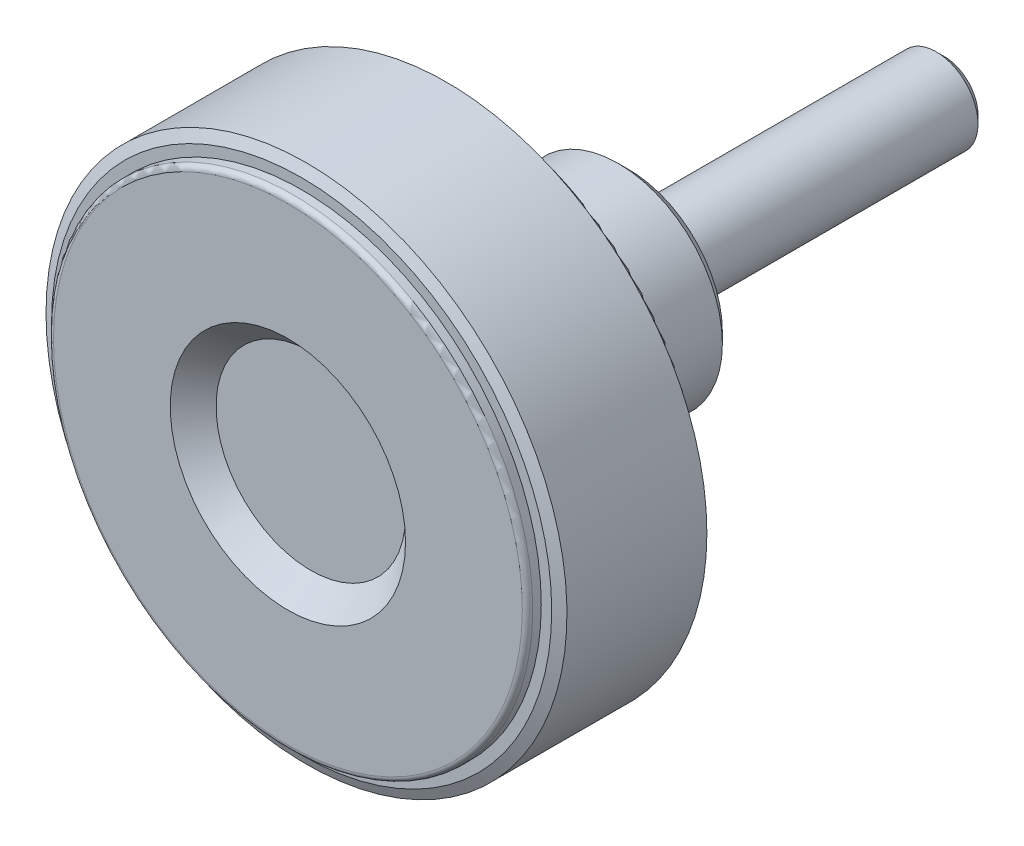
ISO-10303-21;
HEADER;
FILE_DESCRIPTION(('STEP AP214'),'2;1');
FILE_NAME('part.step','',(''),(''),'','','');
FILE_SCHEMA(('AUTOMOTIVE_DESIGN { 1 0 10303 214 1 1 1 1 }'));
ENDSEC;
DATA;
#1=APPLICATION_CONTEXT('core data for automotive mechanical design processes');
#2=APPLICATION_PROTOCOL_DEFINITION('international standard','automotive_design',2000,#1);
#3=PRODUCT_CONTEXT('',#1,'mechanical');
#4=PRODUCT('Part','Part','',(#3));
#5=PRODUCT_RELATED_PRODUCT_CATEGORY('part','',(#4));
#6=PRODUCT_DEFINITION_FORMATION('','',#4);
#7=PRODUCT_DEFINITION_CONTEXT('part definition',#1,'design');
#8=PRODUCT_DEFINITION('design','',#6,#7);
#9=PRODUCT_DEFINITION_SHAPE('','',#8);
#10=(LENGTH_UNIT() NAMED_UNIT(*) SI_UNIT(.MILLI.,.METRE.));
#11=(NAMED_UNIT(*) PLANE_ANGLE_UNIT() SI_UNIT($,.RADIAN.));
#12=(NAMED_UNIT(*) SI_UNIT($,.STERADIAN.) SOLID_ANGLE_UNIT());
#13=UNCERTAINTY_MEASURE_WITH_UNIT(LENGTH_MEASURE(1.E-05),#10,'distance_accuracy_value','');
#14=(GEOMETRIC_REPRESENTATION_CONTEXT(3) GLOBAL_UNCERTAINTY_ASSIGNED_CONTEXT((#13)) GLOBAL_UNIT_ASSIGNED_CONTEXT((#10,
#11,#12)) REPRESENTATION_CONTEXT('',''));
#15=CARTESIAN_POINT('',(0.,0.,0.));
#16=DIRECTION('',(0.,0.,1.));
#17=DIRECTION('',(1.,0.,0.));
#18=AXIS2_PLACEMENT_3D('',#15,#16,#17);
#19=CARTESIAN_POINT('',(0.,1.6165,-30.));
#20=DIRECTION('',(0.,0.,-1.));
#21=DIRECTION('',(-1.,0.,0.));
#22=AXIS2_PLACEMENT_3D('',#19,#20,#21);
#23=PLANE('',#22);
#24=CARTESIAN_POINT('',(0.,0.,-30.0000000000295));
#25=DIRECTION('',(0.,0.,1.));
#26=DIRECTION('',(1.,0.,0.));
#27=AXIS2_PLACEMENT_3D('',#24,#25,#26);
#28=CIRCLE('',#27,3.23299999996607);
#29=CARTESIAN_POINT('',(3.23299999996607,0.,-30.0000000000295));
#30=VERTEX_POINT('',#29);
#31=EDGE_CURVE('E179',#30,#30,#28,.T.);
#32=ORIENTED_EDGE('',*,*,#31,.F.);
#33=EDGE_LOOP('',(#32));
#34=FACE_BOUND('',#33,.T.);
#35=ADVANCED_FACE('F14',(#34),#23,.T.);
#36=CARTESIAN_POINT('',(0.,0.,-29.2329999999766));
#37=DIRECTION('',(0.,0.,1.));
#38=DIRECTION('',(1.,0.,0.));
#39=AXIS2_PLACEMENT_3D('',#36,#37,#38);
#40=CONICAL_SURFACE('',#39,3.99999999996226,0.785398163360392);
#41=ORIENTED_EDGE('',*,*,#31,.T.);
#42=EDGE_LOOP('',(#41));
#43=FACE_BOUND('',#42,.T.);
#44=CARTESIAN_POINT('',(0.,0.,-29.233));
#45=DIRECTION('',(0.,0.,1.));
#46=DIRECTION('',(1.,0.,0.));
#47=AXIS2_PLACEMENT_3D('',#44,#45,#46);
#48=CIRCLE('',#47,4.);
#49=CARTESIAN_POINT('',(4.,0.,-29.233));
#50=VERTEX_POINT('',#49);
#51=EDGE_CURVE('E176',#50,#50,#48,.T.);
#52=ORIENTED_EDGE('',*,*,#51,.F.);
#53=EDGE_LOOP('',(#52));
#54=FACE_BOUND('',#53,.T.);
#55=ADVANCED_FACE('F510',(#43,#54),#40,.T.);
#56=CARTESIAN_POINT('',(0.,0.,-14.1165));
#57=DIRECTION('',(0.,0.,1.));
#58=DIRECTION('',(1.,0.,0.));
#59=AXIS2_PLACEMENT_3D('',#56,#57,#58);
#60=CYLINDRICAL_SURFACE('',#59,4.);
#61=ORIENTED_EDGE('',*,*,#51,.T.);
#62=EDGE_LOOP('',(#61));
#63=FACE_BOUND('',#62,.T.);
#64=CARTESIAN_POINT('',(0.,0.,0.));
#65=DIRECTION('',(0.,0.,1.));
#66=DIRECTION('',(1.,0.,0.));
#67=AXIS2_PLACEMENT_3D('',#64,#65,#66);
#68=CIRCLE('',#67,4.);
#69=CARTESIAN_POINT('',(4.,0.,0.));
#70=VERTEX_POINT('',#69);
#71=EDGE_CURVE('E178',#70,#70,#68,.T.);
#72=ORIENTED_EDGE('',*,*,#71,.F.);
#73=EDGE_LOOP('',(#72));
#74=FACE_BOUND('',#73,.T.);
#75=ADVANCED_FACE('F501',(#63,#74),#60,.T.);
#76=CARTESIAN_POINT('',(0.,2.66666666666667,0.));
#77=DIRECTION('',(0.,0.,-1.));
#78=DIRECTION('',(-1.,0.,0.));
#79=AXIS2_PLACEMENT_3D('',#76,#77,#78);
#80=PLANE('',#79);
#81=CARTESIAN_POINT('',(0.,0.,0.));
#82=DIRECTION('',(0.,0.,1.));
#83=DIRECTION('',(1.,0.,0.));
#84=AXIS2_PLACEMENT_3D('',#81,#82,#83);
#85=CIRCLE('',#84,5.33333333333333);
#86=CARTESIAN_POINT('',(5.33333333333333,0.,0.));
#87=VERTEX_POINT('',#86);
#88=EDGE_CURVE('E211',#87,#87,#85,.T.);
#89=ORIENTED_EDGE('',*,*,#88,.F.);
#90=EDGE_LOOP('',(#89));
#91=FACE_BOUND('',#90,.T.);
#92=ORIENTED_EDGE('',*,*,#71,.T.);
#93=EDGE_LOOP('',(#92));
#94=FACE_BOUND('',#93,.T.);
#95=ADVANCED_FACE('F492',(#91,#94),#80,.T.);
#96=CARTESIAN_POINT('',(0.,0.,0.15));
#97=DIRECTION('',(0.,0.,1.));
#98=DIRECTION('',(1.,0.,0.));
#99=AXIS2_PLACEMENT_3D('',#96,#97,#98);
#100=CYLINDRICAL_SURFACE('',#99,5.33333333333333);
#101=ORIENTED_EDGE('',*,*,#88,.T.);
#102=EDGE_LOOP('',(#101));
#103=FACE_BOUND('',#102,.T.);
#104=CARTESIAN_POINT('',(0.,0.,0.3));
#105=DIRECTION('',(0.,0.,1.));
#106=DIRECTION('',(1.,0.,0.));
#107=AXIS2_PLACEMENT_3D('',#104,#105,#106);
#108=CIRCLE('',#107,5.33333333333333);
#109=CARTESIAN_POINT('',(5.33333333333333,0.,0.3));
#110=VERTEX_POINT('',#109);
#111=EDGE_CURVE('E208',#110,#110,#108,.T.);
#112=ORIENTED_EDGE('',*,*,#111,.F.);
#113=EDGE_LOOP('',(#112));
#114=FACE_BOUND('',#113,.T.);
#115=ADVANCED_FACE('F483',(#103,#114),#100,.T.);
#116=CARTESIAN_POINT('',(0.,7.16666666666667,0.3));
#117=DIRECTION('',(0.,0.,-1.));
#118=DIRECTION('',(-1.,0.,0.));
#119=AXIS2_PLACEMENT_3D('',#116,#117,#118);
#120=PLANE('',#119);
#121=CARTESIAN_POINT('',(0.,0.,0.3));
#122=DIRECTION('',(0.,0.,1.));
#123=DIRECTION('',(1.,0.,0.));
#124=AXIS2_PLACEMENT_3D('',#121,#122,#123);
#125=CIRCLE('',#124,9.);
#126=CARTESIAN_POINT('',(9.,0.,0.3));
#127=VERTEX_POINT('',#126);
#128=EDGE_CURVE('E175',#127,#127,#125,.T.);
#129=ORIENTED_EDGE('',*,*,#128,.F.);
#130=EDGE_LOOP('',(#129));
#131=FACE_BOUND('',#130,.T.);
#132=ORIENTED_EDGE('',*,*,#111,.T.);
#133=EDGE_LOOP('',(#132));
#134=FACE_BOUND('',#133,.T.);
#135=ADVANCED_FACE('F474',(#131,#134),#120,.T.);
#136=CARTESIAN_POINT('',(0.,0.,1.3));
#137=DIRECTION('',(0.,0.,1.));
#138=DIRECTION('',(1.,0.,0.));
#139=AXIS2_PLACEMENT_3D('',#136,#137,#138);
#140=CONICAL_SURFACE('',#139,10.,0.785398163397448);
#141=ORIENTED_EDGE('',*,*,#128,.T.);
#142=EDGE_LOOP('',(#141));
#143=FACE_BOUND('',#142,.T.);
#144=CARTESIAN_POINT('',(0.,0.,1.3));
#145=DIRECTION('',(0.,0.,1.));
#146=DIRECTION('',(1.,0.,0.));
#147=AXIS2_PLACEMENT_3D('',#144,#145,#146);
#148=CIRCLE('',#147,10.);
#149=CARTESIAN_POINT('',(10.,0.,1.3));
#150=VERTEX_POINT('',#149);
#151=EDGE_CURVE('E172',#150,#150,#148,.T.);
#152=ORIENTED_EDGE('',*,*,#151,.F.);
#153=EDGE_LOOP('',(#152));
#154=FACE_BOUND('',#153,.T.);
#155=ADVANCED_FACE('F466',(#143,#154),#140,.T.);
#156=CARTESIAN_POINT('',(0.,0.,13.9));
#157=DIRECTION('',(0.,0.,1.));
#158=DIRECTION('',(1.,0.,0.));
#159=AXIS2_PLACEMENT_3D('',#156,#157,#158);
#160=CYLINDRICAL_SURFACE('',#159,10.);
#161=ORIENTED_EDGE('',*,*,#151,.T.);
#162=EDGE_LOOP('',(#161));
#163=FACE_BOUND('',#162,.T.);
#164=CARTESIAN_POINT('',(0.,0.,26.5));
#165=DIRECTION('',(0.,0.,-1.));
#166=DIRECTION('',(-1.,0.,0.));
#167=AXIS2_PLACEMENT_3D('',#164,#165,#166);
#168=CIRCLE('',#167,10.);
#169=CARTESIAN_POINT('',(-10.,0.,26.5));
#170=VERTEX_POINT('',#169);
#171=EDGE_CURVE('E75',#170,#170,#168,.T.);
#172=ORIENTED_EDGE('',*,*,#171,.T.);
#173=EDGE_LOOP('',(#172));
#174=FACE_BOUND('',#173,.T.);
#175=ADVANCED_FACE('F459',(#163,#174),#160,.T.);
#176=CARTESIAN_POINT('',(0.,0.,26.5));
#177=DIRECTION('',(0.,0.,-1.));
#178=DIRECTION('',(-1.,0.,0.));
#179=AXIS2_PLACEMENT_3D('',#176,#177,#178);
#180=TOROIDAL_SURFACE('',#179,11.,1.);
#181=CARTESIAN_POINT('',(0.,0.,27.5));
#182=DIRECTION('',(0.,0.,-1.));
#183=DIRECTION('',(1.,0.,0.));
#184=AXIS2_PLACEMENT_3D('',#181,#182,#183);
#185=CIRCLE('',#184,11.);
#186=CARTESIAN_POINT('',(-11.,0.,27.5));
#187=VERTEX_POINT('',#186);
#188=CARTESIAN_POINT('',(11.,0.,27.5));
#189=VERTEX_POINT('',#188);
#190=EDGE_CURVE('E68',#187,#189,#185,.F.);
#191=ORIENTED_EDGE('',*,*,#190,.F.);
#192=CARTESIAN_POINT('',(0.,0.,27.5));
#193=DIRECTION('',(0.,0.,-1.));
#194=DIRECTION('',(-1.,0.,0.));
#195=AXIS2_PLACEMENT_3D('',#192,#193,#194);
#196=CIRCLE('',#195,11.);
#197=CARTESIAN_POINT('',(0.,11.,27.5));
#198=VERTEX_POINT('',#197);
#199=EDGE_CURVE('E71',#198,#187,#196,.F.);
#200=ORIENTED_EDGE('',*,*,#199,.F.);
#201=CARTESIAN_POINT('',(0.,0.,27.5));
#202=DIRECTION('',(0.,0.,-1.));
#203=DIRECTION('',(0.,1.,0.));
#204=AXIS2_PLACEMENT_3D('',#201,#202,#203);
#205=CIRCLE('',#204,11.);
#206=EDGE_CURVE('E63',#189,#198,#205,.F.);
#207=ORIENTED_EDGE('',*,*,#206,.F.);
#208=EDGE_LOOP('',(#191,#200,#207));
#209=FACE_BOUND('',#208,.T.);
#210=ORIENTED_EDGE('',*,*,#171,.F.);
#211=EDGE_LOOP('',(#210));
#212=FACE_BOUND('',#211,.T.);
#213=ADVANCED_FACE('F66',(#209,#212),#180,.F.);
#214=CARTESIAN_POINT('',(0.,14.6153846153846,27.5));
#215=DIRECTION('',(0.,0.,-1.));
#216=DIRECTION('',(-1.,0.,0.));
#217=AXIS2_PLACEMENT_3D('',#214,#215,#216);
#218=PLANE('',#217);
#219=CARTESIAN_POINT('',(0.,0.,27.5));
#220=DIRECTION('',(0.,0.,1.));
#221=DIRECTION('',(-1.,0.,0.));
#222=AXIS2_PLACEMENT_3D('',#219,#220,#221);
#223=CIRCLE('',#222,18.2307692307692);
#224=CARTESIAN_POINT('',(18.2307692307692,0.,27.5));
#225=VERTEX_POINT('',#224);
#226=CARTESIAN_POINT('',(-18.2307692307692,0.,27.5));
#227=VERTEX_POINT('',#226);
#228=EDGE_CURVE('E81',#225,#227,#223,.F.);
#229=ORIENTED_EDGE('',*,*,#228,.T.);
#230=CARTESIAN_POINT('',(0.,0.,27.5));
#231=DIRECTION('',(0.,0.,1.));
#232=DIRECTION('',(0.,1.,0.));
#233=AXIS2_PLACEMENT_3D('',#230,#231,#232);
#234=CIRCLE('',#233,18.2307692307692);
#235=CARTESIAN_POINT('',(0.,18.2307692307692,27.5));
#236=VERTEX_POINT('',#235);
#237=EDGE_CURVE('E130',#227,#236,#234,.F.);
#238=ORIENTED_EDGE('',*,*,#237,.T.);
#239=CARTESIAN_POINT('',(0.,0.,27.5));
#240=DIRECTION('',(0.,0.,1.));
#241=DIRECTION('',(1.,0.,0.));
#242=AXIS2_PLACEMENT_3D('',#239,#240,#241);
#243=CIRCLE('',#242,18.2307692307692);
#244=EDGE_CURVE('E143',#236,#225,#243,.F.);
#245=ORIENTED_EDGE('',*,*,#244,.T.);
#246=EDGE_LOOP('',(#229,#238,#245));
#247=FACE_BOUND('',#246,.T.);
#248=ORIENTED_EDGE('',*,*,#199,.T.);
#249=ORIENTED_EDGE('',*,*,#190,.T.);
#250=ORIENTED_EDGE('',*,*,#206,.T.);
#251=EDGE_LOOP('',(#248,#249,#250));
#252=FACE_BOUND('',#251,.T.);
#253=ADVANCED_FACE('F79',(#247,#252),#218,.T.);
#254=CARTESIAN_POINT('',(0.,0.,26.5));
#255=DIRECTION('',(0.,0.,-1.));
#256=DIRECTION('',(-1.,0.,0.));
#257=AXIS2_PLACEMENT_3D('',#254,#255,#256);
#258=TOROIDAL_SURFACE('',#257,18.2307692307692,1.);
#259=ORIENTED_EDGE('',*,*,#237,.F.);
#260=ORIENTED_EDGE('',*,*,#228,.F.);
#261=ORIENTED_EDGE('',*,*,#244,.F.);
#262=EDGE_LOOP('',(#259,#260,#261));
#263=FACE_BOUND('',#262,.T.);
#264=CARTESIAN_POINT('',(0.,0.,26.5));
#265=DIRECTION('',(0.,0.,1.));
#266=DIRECTION('',(1.,0.,0.));
#267=AXIS2_PLACEMENT_3D('',#264,#265,#266);
#268=CIRCLE('',#267,19.2307692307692);
#269=CARTESIAN_POINT('',(19.2307692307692,0.,26.5));
#270=VERTEX_POINT('',#269);
#271=EDGE_CURVE('E205',#270,#270,#268,.F.);
#272=ORIENTED_EDGE('',*,*,#271,.T.);
#273=EDGE_LOOP('',(#272));
#274=FACE_BOUND('',#273,.T.);
#275=ADVANCED_FACE('F100',(#263,#274),#258,.F.);
#276=CARTESIAN_POINT('',(0.,0.,21.25));
#277=DIRECTION('',(0.,0.,1.));
#278=DIRECTION('',(1.,0.,0.));
#279=AXIS2_PLACEMENT_3D('',#276,#277,#278);
#280=CYLINDRICAL_SURFACE('',#279,19.2307692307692);
#281=ORIENTED_EDGE('',*,*,#271,.F.);
#282=EDGE_LOOP('',(#281));
#283=FACE_BOUND('',#282,.T.);
#284=CARTESIAN_POINT('',(0.,0.,16.));
#285=DIRECTION('',(0.,0.,1.));
#286=DIRECTION('',(1.,0.,0.));
#287=AXIS2_PLACEMENT_3D('',#284,#285,#286);
#288=CIRCLE('',#287,19.2307692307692);
#289=CARTESIAN_POINT('',(19.2307692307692,0.,16.));
#290=VERTEX_POINT('',#289);
#291=EDGE_CURVE('E201',#290,#290,#288,.T.);
#292=ORIENTED_EDGE('',*,*,#291,.F.);
#293=EDGE_LOOP('',(#292));
#294=FACE_BOUND('',#293,.T.);
#295=ADVANCED_FACE('F329',(#283,#294),#280,.F.);
#296=CARTESIAN_POINT('',(0.,20.8653846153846,16.));
#297=DIRECTION('',(0.,0.,-1.));
#298=DIRECTION('',(-1.,0.,0.));
#299=AXIS2_PLACEMENT_3D('',#296,#297,#298);
#300=PLANE('',#299);
#301=CARTESIAN_POINT('',(0.,0.,16.));
#302=DIRECTION('',(0.,0.,1.));
#303=DIRECTION('',(-1.,0.,0.));
#304=AXIS2_PLACEMENT_3D('',#301,#302,#303);
#305=CIRCLE('',#304,22.5);
#306=CARTESIAN_POINT('',(-22.5,0.,16.));
#307=VERTEX_POINT('',#306);
#308=CARTESIAN_POINT('',(22.5,0.,16.));
#309=VERTEX_POINT('',#308);
#310=EDGE_CURVE('E264',#307,#309,#305,.T.);
#311=ORIENTED_EDGE('',*,*,#310,.F.);
#312=CARTESIAN_POINT('',(0.,0.,16.));
#313=DIRECTION('',(0.,0.,1.));
#314=DIRECTION('',(0.,1.,0.));
#315=AXIS2_PLACEMENT_3D('',#312,#313,#314);
#316=CIRCLE('',#315,22.5);
#317=CARTESIAN_POINT('',(0.,22.5,16.));
#318=VERTEX_POINT('',#317);
#319=EDGE_CURVE('E299',#318,#307,#316,.T.);
#320=ORIENTED_EDGE('',*,*,#319,.F.);
#321=CARTESIAN_POINT('',(0.,0.,16.));
#322=DIRECTION('',(0.,0.,1.));
#323=DIRECTION('',(1.,0.,0.));
#324=AXIS2_PLACEMENT_3D('',#321,#322,#323);
#325=CIRCLE('',#324,22.5);
#326=EDGE_CURVE('E204',#309,#318,#325,.T.);
#327=ORIENTED_EDGE('',*,*,#326,.F.);
#328=EDGE_LOOP('',(#311,#320,#327));
#329=FACE_BOUND('',#328,.T.);
#330=ORIENTED_EDGE('',*,*,#291,.T.);
#331=EDGE_LOOP('',(#330));
#332=FACE_BOUND('',#331,.T.);
#333=ADVANCED_FACE('F275',(#329,#332),#300,.T.);
#334=CARTESIAN_POINT('',(0.,0.,16.5));
#335=DIRECTION('',(0.,0.,-1.));
#336=DIRECTION('',(-1.,0.,0.));
#337=AXIS2_PLACEMENT_3D('',#334,#335,#336);
#338=TOROIDAL_SURFACE('',#337,22.5,0.5);
#339=ORIENTED_EDGE('',*,*,#319,.T.);
#340=ORIENTED_EDGE('',*,*,#310,.T.);
#341=ORIENTED_EDGE('',*,*,#326,.T.);
#342=EDGE_LOOP('',(#339,#340,#341));
#343=FACE_BOUND('',#342,.T.);
#344=CARTESIAN_POINT('',(0.,0.,16.5));
#345=DIRECTION('',(0.,0.,1.));
#346=DIRECTION('',(1.,0.,0.));
#347=AXIS2_PLACEMENT_3D('',#344,#345,#346);
#348=CIRCLE('',#347,23.);
#349=CARTESIAN_POINT('',(23.,0.,16.5));
#350=VERTEX_POINT('',#349);
#351=EDGE_CURVE('E200',#350,#350,#348,.T.);
#352=ORIENTED_EDGE('',*,*,#351,.F.);
#353=EDGE_LOOP('',(#352));
#354=FACE_BOUND('',#353,.T.);
#355=ADVANCED_FACE('F269',(#343,#354),#338,.T.);
#356=CARTESIAN_POINT('',(0.,0.,16.91));
#357=DIRECTION('',(0.,0.,1.));
#358=DIRECTION('',(1.,0.,0.));
#359=AXIS2_PLACEMENT_3D('',#356,#357,#358);
#360=CYLINDRICAL_SURFACE('',#359,23.);
#361=ORIENTED_EDGE('',*,*,#351,.T.);
#362=EDGE_LOOP('',(#361));
#363=FACE_BOUND('',#362,.T.);
#364=CARTESIAN_POINT('',(0.,0.,17.32));
#365=DIRECTION('',(0.,0.,1.));
#366=DIRECTION('',(1.,0.,0.));
#367=AXIS2_PLACEMENT_3D('',#364,#365,#366);
#368=CIRCLE('',#367,23.);
#369=CARTESIAN_POINT('',(23.,0.,17.32));
#370=VERTEX_POINT('',#369);
#371=EDGE_CURVE('E197',#370,#370,#368,.T.);
#372=ORIENTED_EDGE('',*,*,#371,.F.);
#373=EDGE_LOOP('',(#372));
#374=FACE_BOUND('',#373,.T.);
#375=ADVANCED_FACE('F274',(#363,#374),#360,.T.);
#376=CARTESIAN_POINT('',(0.,23.5,17.32));
#377=DIRECTION('',(0.,0.,-1.));
#378=DIRECTION('',(-1.,0.,0.));
#379=AXIS2_PLACEMENT_3D('',#376,#377,#378);
#380=PLANE('',#379);
#381=CARTESIAN_POINT('',(0.,0.,17.32));
#382=DIRECTION('',(0.,0.,1.));
#383=DIRECTION('',(1.,0.,0.));
#384=AXIS2_PLACEMENT_3D('',#381,#382,#383);
#385=CIRCLE('',#384,24.);
#386=CARTESIAN_POINT('',(24.,0.,17.32));
#387=VERTEX_POINT('',#386);
#388=EDGE_CURVE('E193',#387,#387,#385,.T.);
#389=ORIENTED_EDGE('',*,*,#388,.F.);
#390=EDGE_LOOP('',(#389));
#391=FACE_BOUND('',#390,.T.);
#392=ORIENTED_EDGE('',*,*,#371,.T.);
#393=EDGE_LOOP('',(#392));
#394=FACE_BOUND('',#393,.T.);
#395=ADVANCED_FACE('F341',(#391,#394),#380,.T.);
#396=CARTESIAN_POINT('',(0.,0.,17.786307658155));
#397=DIRECTION('',(0.,0.,1.));
#398=DIRECTION('',(1.,0.,0.));
#399=AXIS2_PLACEMENT_3D('',#396,#397,#398);
#400=CONICAL_SURFACE('',#399,25.,1.13446401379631);
#401=CARTESIAN_POINT('',(4.86721773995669E-13,1.73372427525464E-12,17.786307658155));
#402=DIRECTION('',(0.,0.,-1.));
#403=DIRECTION('',(-1.,0.,0.));
#404=AXIS2_PLACEMENT_3D('',#401,#402,#403);
#405=CIRCLE('',#404,24.9999999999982);
#406=CARTESIAN_POINT('',(-24.9999999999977,1.73372427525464E-12,17.786307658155));
#407=VERTEX_POINT('',#406);
#408=EDGE_CURVE('E196',#407,#407,#405,.F.);
#409=ORIENTED_EDGE('',*,*,#408,.F.);
#410=EDGE_LOOP('',(#409));
#411=FACE_BOUND('',#410,.T.);
#412=ORIENTED_EDGE('',*,*,#388,.T.);
#413=EDGE_LOOP('',(#412));
#414=FACE_BOUND('',#413,.T.);
#415=ADVANCED_FACE('F339',(#411,#414),#400,.T.);
#416=CARTESIAN_POINT('',(0.,4.54545454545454,30.8));
#417=DIRECTION('',(0.,0.,1.));
#418=DIRECTION('',(1.,0.,0.));
#419=AXIS2_PLACEMENT_3D('',#416,#417,#418);
#420=PLANE('',#419);
#421=CARTESIAN_POINT('',(0.,0.,30.8));
#422=DIRECTION('',(0.,0.,1.));
#423=DIRECTION('',(1.,0.,0.));
#424=AXIS2_PLACEMENT_3D('',#421,#422,#423);
#425=CIRCLE('',#424,9.0909090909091);
#426=CARTESIAN_POINT('',(9.0909090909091,0.,30.8));
#427=VERTEX_POINT('',#426);
#428=EDGE_CURVE('E181',#427,#427,#425,.T.);
#429=ORIENTED_EDGE('',*,*,#428,.T.);
#430=EDGE_LOOP('',(#429));
#431=FACE_BOUND('',#430,.T.);
#432=ADVANCED_FACE('F242',(#431),#420,.T.);
#433=CARTESIAN_POINT('',(0.,0.,33.));
#434=DIRECTION('',(0.,0.,1.));
#435=DIRECTION('',(1.,0.,0.));
#436=AXIS2_PLACEMENT_3D('',#433,#434,#435);
#437=CONICAL_SURFACE('',#436,11.2909090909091,0.785398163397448);
#438=CARTESIAN_POINT('',(0.,0.,33.));
#439=DIRECTION('',(0.,0.,1.));
#440=DIRECTION('',(1.,0.,0.));
#441=AXIS2_PLACEMENT_3D('',#438,#439,#440);
#442=CIRCLE('',#441,11.2909090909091);
#443=CARTESIAN_POINT('',(11.2909090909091,0.,33.));
#444=VERTEX_POINT('',#443);
#445=EDGE_CURVE('E9',#444,#444,#442,.F.);
#446=ORIENTED_EDGE('',*,*,#445,.F.);
#447=EDGE_LOOP('',(#446));
#448=FACE_BOUND('',#447,.T.);
#449=ORIENTED_EDGE('',*,*,#428,.F.);
#450=EDGE_LOOP('',(#449));
#451=FACE_BOUND('',#450,.T.);
#452=ADVANCED_FACE('F240',(#448,#451),#437,.F.);
#453=CARTESIAN_POINT('',(0.,16.8954545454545,33.));
#454=DIRECTION('',(0.,0.,1.));
#455=DIRECTION('',(1.,0.,0.));
#456=AXIS2_PLACEMENT_3D('',#453,#454,#455);
#457=PLANE('',#456);
#458=ORIENTED_EDGE('',*,*,#445,.T.);
#459=EDGE_LOOP('',(#458));
#460=FACE_BOUND('',#459,.T.);
#461=CARTESIAN_POINT('',(0.,0.,33.));
#462=DIRECTION('',(0.,0.,-1.));
#463=DIRECTION('',(-1.,0.,0.));
#464=AXIS2_PLACEMENT_3D('',#461,#462,#463);
#465=CIRCLE('',#464,22.5);
#466=CARTESIAN_POINT('',(0.,22.5,33.));
#467=VERTEX_POINT('',#466);
#468=CARTESIAN_POINT('',(-22.5,0.,33.));
#469=VERTEX_POINT('',#468);
#470=EDGE_CURVE('E219',#467,#469,#465,.F.);
#471=ORIENTED_EDGE('',*,*,#470,.T.);
#472=CARTESIAN_POINT('',(0.,0.,33.));
#473=DIRECTION('',(0.,0.,-1.));
#474=DIRECTION('',(1.,0.,0.));
#475=AXIS2_PLACEMENT_3D('',#472,#473,#474);
#476=CIRCLE('',#475,22.5);
#477=CARTESIAN_POINT('',(22.5,0.,33.));
#478=VERTEX_POINT('',#477);
#479=EDGE_CURVE('E23',#469,#478,#476,.F.);
#480=ORIENTED_EDGE('',*,*,#479,.T.);
#481=CARTESIAN_POINT('',(0.,0.,33.));
#482=DIRECTION('',(0.,0.,-1.));
#483=DIRECTION('',(0.,1.,0.));
#484=AXIS2_PLACEMENT_3D('',#481,#482,#483);
#485=CIRCLE('',#484,22.5);
#486=EDGE_CURVE('E184',#478,#467,#485,.F.);
#487=ORIENTED_EDGE('',*,*,#486,.T.);
#488=EDGE_LOOP('',(#471,#480,#487));
#489=FACE_BOUND('',#488,.T.);
#490=ADVANCED_FACE('F238',(#460,#489),#457,.T.);
#491=CARTESIAN_POINT('',(0.,0.,32.5));
#492=DIRECTION('',(0.,0.,-1.));
#493=DIRECTION('',(-1.,0.,0.));
#494=AXIS2_PLACEMENT_3D('',#491,#492,#493);
#495=TOROIDAL_SURFACE('',#494,22.5,0.5);
#496=CARTESIAN_POINT('',(0.,0.,32.5));
#497=DIRECTION('',(0.,0.,-1.));
#498=DIRECTION('',(-1.,0.,0.));
#499=AXIS2_PLACEMENT_3D('',#496,#497,#498);
#500=CIRCLE('',#499,23.);
#501=CARTESIAN_POINT('',(-23.,0.,32.5));
#502=VERTEX_POINT('',#501);
#503=EDGE_CURVE('E185',#502,#502,#500,.F.);
#504=ORIENTED_EDGE('',*,*,#503,.T.);
#505=EDGE_LOOP('',(#504));
#506=FACE_BOUND('',#505,.T.);
#507=ORIENTED_EDGE('',*,*,#479,.F.);
#508=ORIENTED_EDGE('',*,*,#470,.F.);
#509=ORIENTED_EDGE('',*,*,#486,.F.);
#510=EDGE_LOOP('',(#507,#508,#509));
#511=FACE_BOUND('',#510,.T.);
#512=ADVANCED_FACE('F226',(#506,#511),#495,.T.);
#513=CARTESIAN_POINT('',(0.,0.,32.09));
#514=DIRECTION('',(0.,0.,1.));
#515=DIRECTION('',(1.,0.,0.));
#516=AXIS2_PLACEMENT_3D('',#513,#514,#515);
#517=CYLINDRICAL_SURFACE('',#516,23.);
#518=ORIENTED_EDGE('',*,*,#503,.F.);
#519=EDGE_LOOP('',(#518));
#520=FACE_BOUND('',#519,.T.);
#521=CARTESIAN_POINT('',(0.,0.,31.68));
#522=DIRECTION('',(0.,0.,1.));
#523=DIRECTION('',(1.,0.,0.));
#524=AXIS2_PLACEMENT_3D('',#521,#522,#523);
#525=CIRCLE('',#524,23.);
#526=CARTESIAN_POINT('',(23.,0.,31.68));
#527=VERTEX_POINT('',#526);
#528=EDGE_CURVE('E186',#527,#527,#525,.T.);
#529=ORIENTED_EDGE('',*,*,#528,.T.);
#530=EDGE_LOOP('',(#529));
#531=FACE_BOUND('',#530,.T.);
#532=ADVANCED_FACE('F237',(#520,#531),#517,.T.);
#533=CARTESIAN_POINT('',(0.,0.,31.213692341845));
#534=DIRECTION('',(0.,0.,-1.));
#535=DIRECTION('',(-1.,0.,0.));
#536=AXIS2_PLACEMENT_3D('',#533,#534,#535);
#537=CONICAL_SURFACE('',#536,25.,1.13446401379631);
#538=CARTESIAN_POINT('',(0.,0.,31.68));
#539=DIRECTION('',(0.,0.,-1.));
#540=DIRECTION('',(-1.,0.,0.));
#541=AXIS2_PLACEMENT_3D('',#538,#539,#540);
#542=CIRCLE('',#541,24.);
#543=CARTESIAN_POINT('',(-24.,0.,31.68));
#544=VERTEX_POINT('',#543);
#545=EDGE_CURVE('E189',#544,#544,#542,.F.);
#546=ORIENTED_EDGE('',*,*,#545,.F.);
#547=EDGE_LOOP('',(#546));
#548=FACE_BOUND('',#547,.T.);
#549=CARTESIAN_POINT('',(0.,0.,31.213692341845));
#550=DIRECTION('',(0.,0.,-1.));
#551=DIRECTION('',(0.,1.,0.));
#552=AXIS2_PLACEMENT_3D('',#549,#550,#551);
#553=CIRCLE('',#552,25.);
#554=CARTESIAN_POINT('',(0.,25.,31.213692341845));
#555=VERTEX_POINT('',#554);
#556=EDGE_CURVE('E192',#555,#555,#553,.F.);
#557=ORIENTED_EDGE('',*,*,#556,.T.);
#558=EDGE_LOOP('',(#557));
#559=FACE_BOUND('',#558,.T.);
#560=ADVANCED_FACE('F358',(#548,#559),#537,.T.);
#561=CARTESIAN_POINT('',(0.,23.5,31.68));
#562=DIRECTION('',(0.,0.,1.));
#563=DIRECTION('',(1.,0.,0.));
#564=AXIS2_PLACEMENT_3D('',#561,#562,#563);
#565=PLANE('',#564);
#566=ORIENTED_EDGE('',*,*,#528,.F.);
#567=EDGE_LOOP('',(#566));
#568=FACE_BOUND('',#567,.T.);
#569=ORIENTED_EDGE('',*,*,#545,.T.);
#570=EDGE_LOOP('',(#569));
#571=FACE_BOUND('',#570,.T.);
#572=ADVANCED_FACE('F356',(#568,#571),#565,.T.);
#573=CARTESIAN_POINT('',(4.86721773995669E-13,1.73372427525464E-12,0.));
#574=DIRECTION('',(0.,0.,-1.));
#575=DIRECTION('',(-1.,0.,0.));
#576=AXIS2_PLACEMENT_3D('',#573,#574,#575);
#577=CYLINDRICAL_SURFACE('',#576,24.9999999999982);
#578=ORIENTED_EDGE('',*,*,#408,.T.);
#579=EDGE_LOOP('',(#578));
#580=FACE_BOUND('',#579,.T.);
#581=ORIENTED_EDGE('',*,*,#556,.F.);
#582=EDGE_LOOP('',(#581));
#583=FACE_BOUND('',#582,.T.);
#584=ADVANCED_FACE('F353',(#580,#583),#577,.T.);
#585=CLOSED_SHELL('',(#35,#55,#75,#95,#115,#135,#155,#175,#213,#253,#275,#295,#333,#355,#375,
#395,#415,#432,#452,#490,#512,#532,#560,#572,#584));
#586=MANIFOLD_SOLID_BREP('B1',#585);
#587=ADVANCED_BREP_SHAPE_REPRESENTATION('',(#18,#586),#14);
#588=SHAPE_DEFINITION_REPRESENTATION(#9,#587);
ENDSEC;
END-ISO-10303-21;
